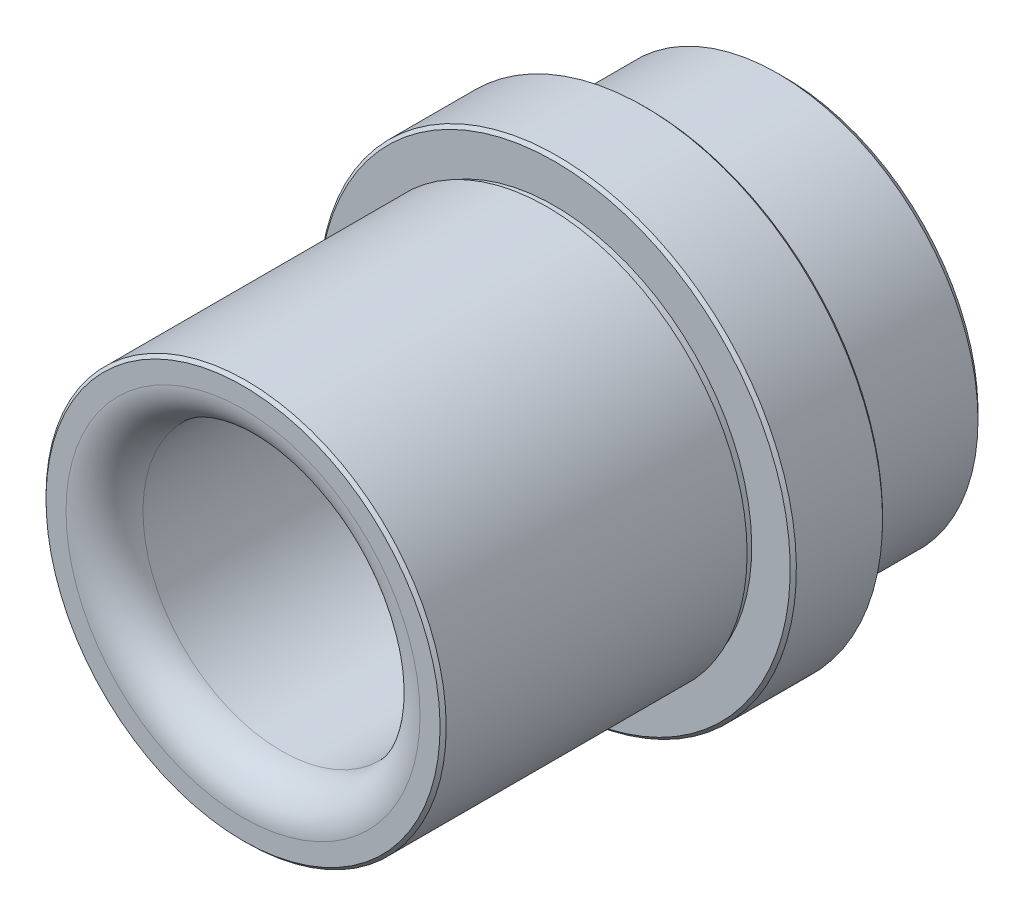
from build123d import *


with BuildPart() as part:
    # Sketch1 → Revolve1 (revolve)
    with BuildSketch(Plane(origin=(0, 0, 0), x_dir=(0, 0, -1), z_dir=(1, 0, 0)), mode=Mode.PRIVATE) as revolve1_sk:
        with BuildLine():
            Line((-26.5, 12.8), (-26.3, 13))
            Line((-26.3, 13), (-6.75, 13))
            Line((-6.75, 13), (-6.75, 12.8))
            Line((-6.75, 12.8), (-6.25, 12.8))
            Line((-6.25, 12.8), (-6.25, 15.3))
            Line((-6.25, 15.3), (-6.05, 15.5))
            Line((-6.05, 15.5), (-0.45, 15.5))
            Line((-0.45, 15.5), (-0.25, 15.3))
            Line((-0.25, 15.3), (-0.25, 12.8))
            Line((-0.25, 12.8), (0.25, 12.8))
            Line((0.25, 12.8), (0.25, 13))
            Line((0.25, 13), (8.25, 13))
            Line((8.25, 13), (8.75, 12.5))
            Line((8.75, 12.5), (8.75, 9))
            Line((8.75, 9), (-24, 9))
            ThreePointArc((-24, 9), (-25.767766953, 9.732233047), (-26.5, 11.5))
            Line((-26.5, 11.5), (-26.5, 12.8))
        make_face()
    revolve(revolve1_sk.sketch.rotate(Axis((0, 0, 26.5), (0, 0, -1)), 180), axis=Axis((0, 0, 26.5), (0, 0, -1)))


solid = part.part
